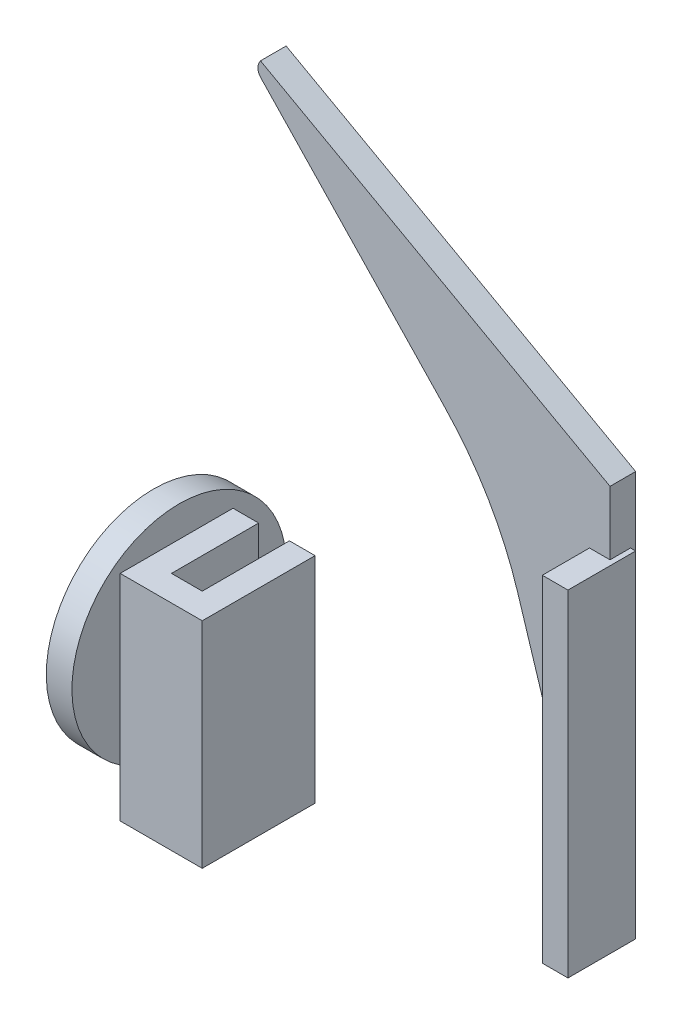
from build123d import *

# Parameters (mm, degrees)
ESQUISSE1_R             = 20.9
ESQUISSE1_R_2           = 6
BOSS_EXTRU_1_DEPTH      = 5
BOSS_EXTRU_2_DEPTH      = 5
BOSS_EXTRU_3_DEPTH      = 20.9
BOSS_EXTRU_3_DEPTH_BACK = 20.9
ESQUISSE12_W            = 13.2
ESQUISSE12_H            = 65.5
BOSS_EXTRU_4_DEPTH      = 5


with BuildPart() as part:
    # Esquisse1 → Boss.-Extru.1 (new body)
    with BuildSketch(Plane(origin=(309.231104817, 0, 0), x_dir=(0, 0, -1), z_dir=(1, 0, 0))):
        with Locations(Location((-925.010645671, 396, 0), (0, 0, 90))):
            Circle(ESQUISSE1_R)
        with Locations(Location((-918.010645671, 396, 0), (0, 0, 90))):
            Circle(ESQUISSE1_R_2, mode=Mode.SUBTRACT)
    extrude(amount=BOSS_EXTRU_1_DEPTH)


with BuildPart() as body_2:
    # Esquisse3 → Boss.-Extru.2 (new body)
    with BuildSketch(Plane.XY.offset(880.010645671)):
        with BuildLine():
            Line((325.967680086, 419.152764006), (290.131514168, 456.808087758))
            ThreePointArc((290.131514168, 456.808087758), (289.596461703, 457.933054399), (289.831051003, 459.156491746))
            Line((289.831051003, 459.156491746), (290.088648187, 459.621209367))
            Line((290.088648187, 459.621209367), (358.231104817, 421.849228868))
            Line((358.231104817, 421.849228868), (358.231104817, 343.938273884))
            Line((358.231104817, 343.938273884), (357.699768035, 343.938273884))
            ThreePointArc((357.699768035, 343.938273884), (356.515994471, 344.326231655), (355.79147506, 345.339593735))
            Line((355.79147506, 345.339593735), (340.231104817, 394.938273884))
            ThreePointArc((340.231104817, 394.938273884), (334.487618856, 407.86324679), (325.967680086, 419.152764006))
        make_face()
    extrude(amount=BOSS_EXTRU_2_DEPTH)

    # Esquisse12 → Boss.-Extru.4 (add)
    with BuildSketch(Plane.ZY.offset(-359.231104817)):
        with Locations((887.610645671, 376.688273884)):
            Rectangle(ESQUISSE12_W, ESQUISSE12_H)
    extrude(amount=BOSS_EXTRU_4_DEPTH)


with BuildPart() as body_3:
    # Esquisse10 → Boss.-Extru.3 (new, two sides: drawn at the far end of the back side and taken through both)
    with BuildSketch(Plane(origin=(0, 396, 0), x_dir=(-1, 0, 0), z_dir=(0, -1, 0)).offset(-BOSS_EXTRU_3_DEPTH_BACK)):
        Polygon((-336.231104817, -920.510645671), (-331.231104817, -920.510645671), (-331.231104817, -937.510645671), (-325.231104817, -937.510645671), (-325.231104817, -920.510645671), (-320.231104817, -920.510645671), (-320.231104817, -942.510645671), (-336.231104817, -942.510645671), align=None)
    extrude(amount=BOSS_EXTRU_3_DEPTH + BOSS_EXTRU_3_DEPTH_BACK)


solid = Compound([part.part, body_2.part, body_3.part])
